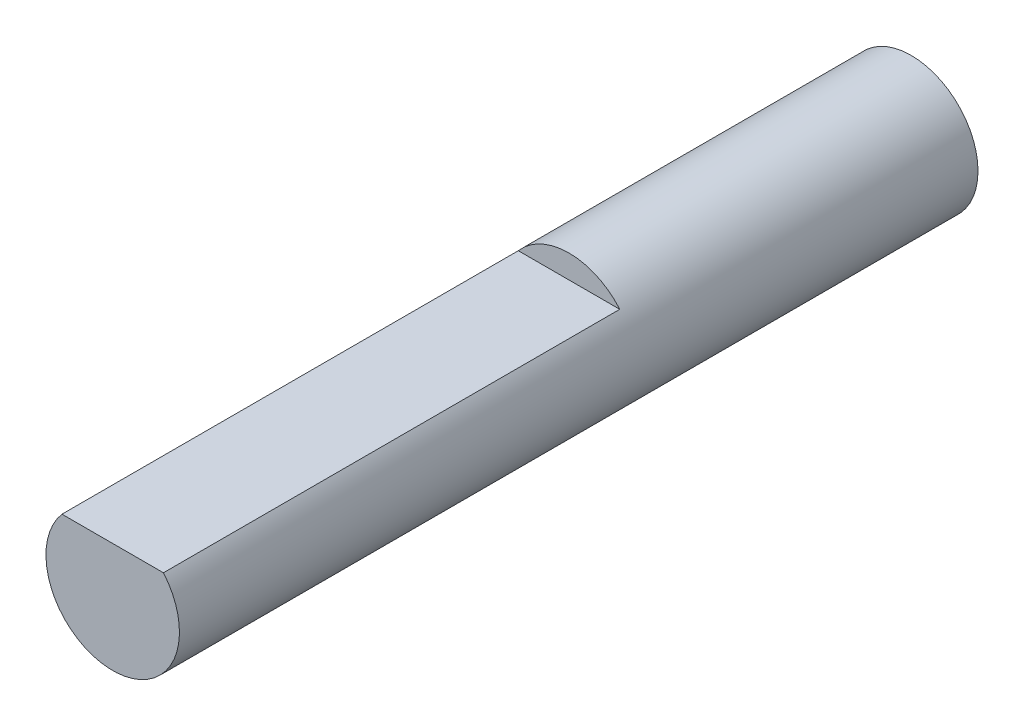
ISO-10303-21;
HEADER;
FILE_DESCRIPTION(('STEP AP214'),'2;1');
FILE_NAME('part.step','',(''),(''),'','','');
FILE_SCHEMA(('AUTOMOTIVE_DESIGN { 1 0 10303 214 1 1 1 1 }'));
ENDSEC;
DATA;
#1=APPLICATION_CONTEXT('core data for automotive mechanical design processes');
#2=APPLICATION_PROTOCOL_DEFINITION('international standard','automotive_design',2000,#1);
#3=PRODUCT_CONTEXT('',#1,'mechanical');
#4=PRODUCT('Part','Part','',(#3));
#5=PRODUCT_RELATED_PRODUCT_CATEGORY('part','',(#4));
#6=PRODUCT_DEFINITION_FORMATION('','',#4);
#7=PRODUCT_DEFINITION_CONTEXT('part definition',#1,'design');
#8=PRODUCT_DEFINITION('design','',#6,#7);
#9=PRODUCT_DEFINITION_SHAPE('','',#8);
#10=(LENGTH_UNIT() NAMED_UNIT(*) SI_UNIT(.MILLI.,.METRE.));
#11=(NAMED_UNIT(*) PLANE_ANGLE_UNIT() SI_UNIT($,.RADIAN.));
#12=(NAMED_UNIT(*) SI_UNIT($,.STERADIAN.) SOLID_ANGLE_UNIT());
#13=UNCERTAINTY_MEASURE_WITH_UNIT(LENGTH_MEASURE(1.E-05),#10,'distance_accuracy_value','');
#14=(GEOMETRIC_REPRESENTATION_CONTEXT(3) GLOBAL_UNCERTAINTY_ASSIGNED_CONTEXT((#13)) GLOBAL_UNIT_ASSIGNED_CONTEXT((#10,
#11,#12)) REPRESENTATION_CONTEXT('',''));
#15=CARTESIAN_POINT('',(0.,0.,0.));
#16=DIRECTION('',(0.,0.,1.));
#17=DIRECTION('',(1.,0.,0.));
#18=AXIS2_PLACEMENT_3D('',#15,#16,#17);
#19=CARTESIAN_POINT('',(0.,0.,17.78));
#20=DIRECTION('',(0.,0.,-1.));
#21=DIRECTION('',(-1.,0.,0.));
#22=AXIS2_PLACEMENT_3D('',#19,#20,#21);
#23=CYLINDRICAL_SURFACE('',#22,1.4859);
#24=CARTESIAN_POINT('',(0.,0.,17.78));
#25=DIRECTION('',(0.,0.,1.));
#26=DIRECTION('',(1.,0.,0.));
#27=AXIS2_PLACEMENT_3D('',#24,#25,#26);
#28=CIRCLE('',#27,1.4859);
#29=CARTESIAN_POINT('',(-1.12972906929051,0.965199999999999,17.78));
#30=VERTEX_POINT('',#29);
#31=CARTESIAN_POINT('',(1.12972906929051,0.965199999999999,17.78));
#32=VERTEX_POINT('',#31);
#33=EDGE_CURVE('E61',#30,#32,#28,.T.);
#34=ORIENTED_EDGE('',*,*,#33,.F.);
#35=DIRECTION('',(0.,0.,-1.));
#36=VECTOR('',#35,1.);
#37=CARTESIAN_POINT('',(-1.12972906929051,0.965199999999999,17.78));
#38=LINE('',#37,#36);
#39=CARTESIAN_POINT('',(-1.12972906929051,0.965199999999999,7.62));
#40=VERTEX_POINT('',#39);
#41=EDGE_CURVE('E47',#30,#40,#38,.T.);
#42=ORIENTED_EDGE('',*,*,#41,.T.);
#43=CARTESIAN_POINT('',(0.,0.,7.62));
#44=DIRECTION('',(0.,0.,1.));
#45=DIRECTION('',(1.,0.,0.));
#46=AXIS2_PLACEMENT_3D('',#43,#44,#45);
#47=CIRCLE('',#46,1.4859);
#48=CARTESIAN_POINT('',(1.12972906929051,0.965199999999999,7.62));
#49=VERTEX_POINT('',#48);
#50=EDGE_CURVE('E11',#49,#40,#47,.T.);
#51=ORIENTED_EDGE('',*,*,#50,.F.);
#52=DIRECTION('',(0.,0.,-1.));
#53=VECTOR('',#52,1.);
#54=CARTESIAN_POINT('',(1.12972906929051,0.965199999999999,17.78));
#55=LINE('',#54,#53);
#56=EDGE_CURVE('E52',#49,#32,#55,.F.);
#57=ORIENTED_EDGE('',*,*,#56,.T.);
#58=EDGE_LOOP('',(#34,#42,#51,#57));
#59=FACE_BOUND('',#58,.T.);
#60=CARTESIAN_POINT('',(0.,0.,0.));
#61=DIRECTION('',(0.,0.,1.));
#62=DIRECTION('',(1.,0.,0.));
#63=AXIS2_PLACEMENT_3D('',#60,#61,#62);
#64=CIRCLE('',#63,1.4859);
#65=CARTESIAN_POINT('',(1.4859,0.,0.));
#66=VERTEX_POINT('',#65);
#67=EDGE_CURVE('E68',#66,#66,#64,.T.);
#68=ORIENTED_EDGE('',*,*,#67,.T.);
#69=EDGE_LOOP('',(#68));
#70=FACE_BOUND('',#69,.T.);
#71=ADVANCED_FACE('F33',(#59,#70),#23,.T.);
#72=CARTESIAN_POINT('',(0.,0.,17.78));
#73=DIRECTION('',(0.,0.,1.));
#74=DIRECTION('',(1.,0.,0.));
#75=AXIS2_PLACEMENT_3D('',#72,#73,#74);
#76=PLANE('',#75);
#77=DIRECTION('',(1.,0.,0.));
#78=VECTOR('',#77,1.);
#79=CARTESIAN_POINT('',(0.,0.965199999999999,17.78));
#80=LINE('',#79,#78);
#81=EDGE_CURVE('E40',#30,#32,#80,.T.);
#82=ORIENTED_EDGE('',*,*,#81,.F.);
#83=ORIENTED_EDGE('',*,*,#33,.T.);
#84=EDGE_LOOP('',(#82,#83));
#85=FACE_BOUND('',#84,.T.);
#86=ADVANCED_FACE('F67',(#85),#76,.T.);
#87=CARTESIAN_POINT('',(0.,0.,0.));
#88=DIRECTION('',(0.,0.,1.));
#89=DIRECTION('',(1.,0.,0.));
#90=AXIS2_PLACEMENT_3D('',#87,#88,#89);
#91=PLANE('',#90);
#92=ORIENTED_EDGE('',*,*,#67,.F.);
#93=EDGE_LOOP('',(#92));
#94=FACE_BOUND('',#93,.T.);
#95=ADVANCED_FACE('F77',(#94),#91,.F.);
#96=CARTESIAN_POINT('',(0.,0.,7.62));
#97=DIRECTION('',(0.,0.,1.));
#98=DIRECTION('',(1.,0.,0.));
#99=AXIS2_PLACEMENT_3D('',#96,#97,#98);
#100=PLANE('',#99);
#101=ORIENTED_EDGE('',*,*,#50,.T.);
#102=DIRECTION('',(1.,0.,0.));
#103=VECTOR('',#102,1.);
#104=CARTESIAN_POINT('',(-1.56373161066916,0.965199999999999,7.62));
#105=LINE('',#104,#103);
#106=EDGE_CURVE('E65',#40,#49,#105,.T.);
#107=ORIENTED_EDGE('',*,*,#106,.T.);
#108=EDGE_LOOP('',(#101,#107));
#109=FACE_BOUND('',#108,.T.);
#110=ADVANCED_FACE('F75',(#109),#100,.T.);
#111=CARTESIAN_POINT('',(-1.56373161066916,0.965199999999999,7.62));
#112=DIRECTION('',(0.,-1.,0.));
#113=DIRECTION('',(0.,0.,-1.));
#114=AXIS2_PLACEMENT_3D('',#111,#112,#113);
#115=PLANE('',#114);
#116=ORIENTED_EDGE('',*,*,#81,.T.);
#117=ORIENTED_EDGE('',*,*,#56,.F.);
#118=ORIENTED_EDGE('',*,*,#106,.F.);
#119=ORIENTED_EDGE('',*,*,#41,.F.);
#120=EDGE_LOOP('',(#116,#117,#118,#119));
#121=FACE_BOUND('',#120,.T.);
#122=ADVANCED_FACE('F57',(#121),#115,.F.);
#123=CLOSED_SHELL('',(#71,#86,#95,#110,#122));
#124=MANIFOLD_SOLID_BREP('B2',#123);
#125=ADVANCED_BREP_SHAPE_REPRESENTATION('',(#18,#124),#14);
#126=SHAPE_DEFINITION_REPRESENTATION(#9,#125);
ENDSEC;
END-ISO-10303-21;
